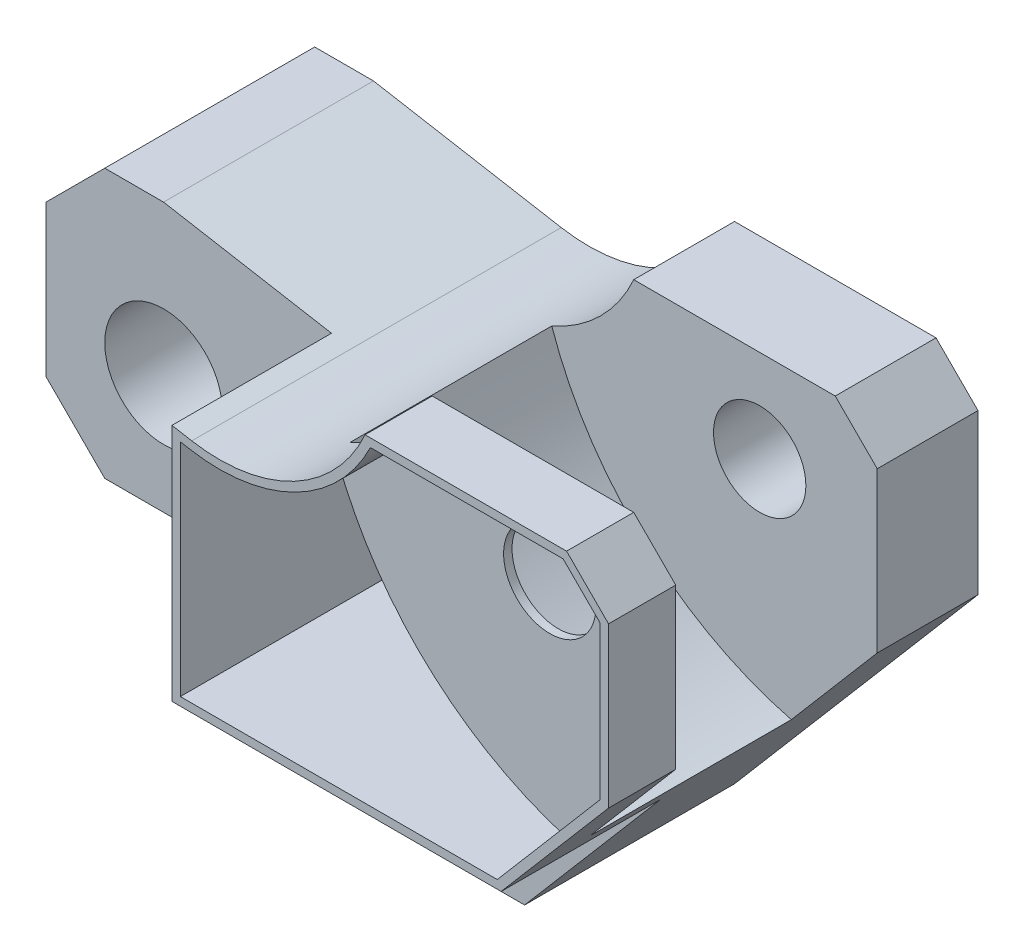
from build123d import *

# Parameters (mm, degrees)
ESQUISSE1_R             = 7
BOSS_EXTRU_1_DEPTH      = 44
ENL_V_START             = -19
ENL_V_MAT_EXTRU_1_DEPTH = 19
ESQUISSE3_R             = 5.5
ENL_V_MAT_EXTRU_2_DEPTH = 62
ENL_V_MAT_EXTRU_3_DEPTH = 24
ENL_V_MAT_EXTRU_4_DEPTH = 7
ENL_V_MAT_EXTRU_5_DEPTH = 25


with BuildPart() as part:
    # Esquisse1 → Boss.-Extru.1 (new body)
    with BuildSketch(Plane.XY):
        with BuildLine():
            Line((14.659992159, 28.604004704), (38.659992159, 28.604004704))
            Line((38.659992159, 28.604004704), (43.659992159, 23.604004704))
            Line((43.659992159, 23.604004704), (43.659992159, 4.604004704))
            Line((43.659992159, 4.604004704), (14.659992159, -29.395995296))
            Line((14.659992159, -29.395995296), (8.956972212, -29.395995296))
            ThreePointArc((8.956972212, -29.395995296), (4.518000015, -22.511667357), (2.181169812, -14.660701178))
            ThreePointArc((2.181169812, -14.660701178), (0.500766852, -11.609409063), (-2.764468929, -10.395995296))
            Line((-2.764468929, -10.395995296), (-35.340007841, -10.395995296))
            Line((-35.340007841, -10.395995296), (-42.340007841, -3.395995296))
            Line((-42.340007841, -3.395995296), (-42.340007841, 14.604004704))
            Line((-42.340007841, 14.604004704), (-35.340007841, 21.604004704))
            Line((-35.340007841, 21.604004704), (-28.340007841, 21.604004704))
            Line((-28.340007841, 21.604004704), (-5.978627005, 17.661089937))
            ThreePointArc((-5.978627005, 17.661089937), (6.221090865, 19.586048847), (14.659992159, 28.604004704))
        make_face()
        with Locations((-28.340007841, 3.604004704)):
            Circle(ESQUISSE1_R, mode=Mode.SUBTRACT)
    extrude(amount=BOSS_EXTRU_1_DEPTH)

    # Esquisse2 → Enl_v. mat.-Extru.1 (cut)
    with BuildSketch(Plane.XY.offset(44).offset(ENL_V_START)):
        Polygon((-8.340007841, 18.07746509), (-8.340007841, -10.395995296), (-35.340007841, -10.395995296), (-42.340007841, -3.395995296), (-42.340007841, 14.604004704), (-35.340007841, 21.604004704), (-28.340007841, 21.604004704), align=None)
        with BuildLine():
            Line((-2.764468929, -10.395995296), (30.865874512, -10.395995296))
            Line((30.865874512, -10.395995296), (14.659992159, -29.395995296))
            Line((14.659992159, -29.395995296), (8.956972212, -29.395995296))
            ThreePointArc((8.956972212, -29.395995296), (4.518000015, -22.511667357), (2.181169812, -14.660701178))
            ThreePointArc((2.181169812, -14.660701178), (0.500766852, -11.609409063), (-2.764468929, -10.395995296))
        make_face()
    extrude(amount=ENL_V_MAT_EXTRU_1_DEPTH, mode=Mode.SUBTRACT)

    # Esquisse3 → Enl_v. mat.-Extru.2 (cut)
    with BuildSketch(Plane.XY.offset(44)):
        with Locations((29.659992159, 17.604004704)):
            Circle(ESQUISSE3_R)
    extrude(amount=-ENL_V_MAT_EXTRU_2_DEPTH, mode=Mode.SUBTRACT)

    # Esquisse4 → Enl_v. mat.-Extru.3 (cut)
    with BuildSketch(Plane(origin=(0, 0, 12), x_dir=(-1, 0, 0), z_dir=(0, 0, -1))):
        with BuildLine():
            Line((-14.659992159, 28.604004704), (-38.659992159, 28.604004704))
            Line((-38.659992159, 28.604004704), (-43.659992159, 23.604004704))
            Line((-43.659992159, 23.604004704), (-43.659992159, 4.604004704))
            Line((-43.659992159, 4.604004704), (-33.424698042, -7.395995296))
            ThreePointArc((-33.424698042, -7.395995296), (-15.844255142, 2.184709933), (-4.896928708, 18.948299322))
            ThreePointArc((-4.896928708, 18.948299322), (-10.681236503, 22.863338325), (-14.659992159, 28.604004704))
        make_face()
    extrude(amount=-ENL_V_MAT_EXTRU_3_DEPTH, mode=Mode.SUBTRACT)

    # Esquisse5 → Enl_v. mat.-Extru.4 (cut)
    with BuildSketch(Plane.XY.offset(44)):
        with BuildLine():
            Line((-7.340007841, 16.885711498), (-7.340007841, -9.395995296))
            Line((-7.340007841, -9.395995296), (30.404468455, -9.395995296))
            Line((30.404468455, -9.395995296), (42.659992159, 4.972549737))
            Line((42.659992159, 4.972549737), (42.659992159, 23.189791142))
            Line((42.659992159, 23.189791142), (38.245778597, 27.604004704))
            Line((38.245778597, 27.604004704), (15.296076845, 27.604004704))
            ThreePointArc((15.296076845, 27.604004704), (6.399997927, 18.552051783), (-6.152275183, 16.676282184))
            Line((-6.152275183, 16.676282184), (-7.340007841, 16.885711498))
        make_face()
    extrude(amount=-ENL_V_MAT_EXTRU_4_DEPTH, mode=Mode.SUBTRACT)

    # Esquisse6 → Enl_v. mat.-Extru.5 (cut)
    with BuildSketch(Plane.XY.offset(37)):
        with BuildLine():
            Line((-6.152275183, 16.676282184), (-7.340007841, 16.885711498))
            Line((-7.340007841, 16.885711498), (-7.340007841, -9.395995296))
            Line((-7.340007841, -9.395995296), (30.404468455, -9.395995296))
            Line((30.404468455, -9.395995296), (31.646839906, -7.93942187))
            ThreePointArc((31.646839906, -7.93942187), (14.970173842, 1.631877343), (4.306675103, 17.63221341))
            ThreePointArc((4.306675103, 17.63221341), (-0.858931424, 16.455454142), (-6.152275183, 16.676282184))
        make_face()
    extrude(amount=-ENL_V_MAT_EXTRU_5_DEPTH, mode=Mode.SUBTRACT)


solid = part.part
